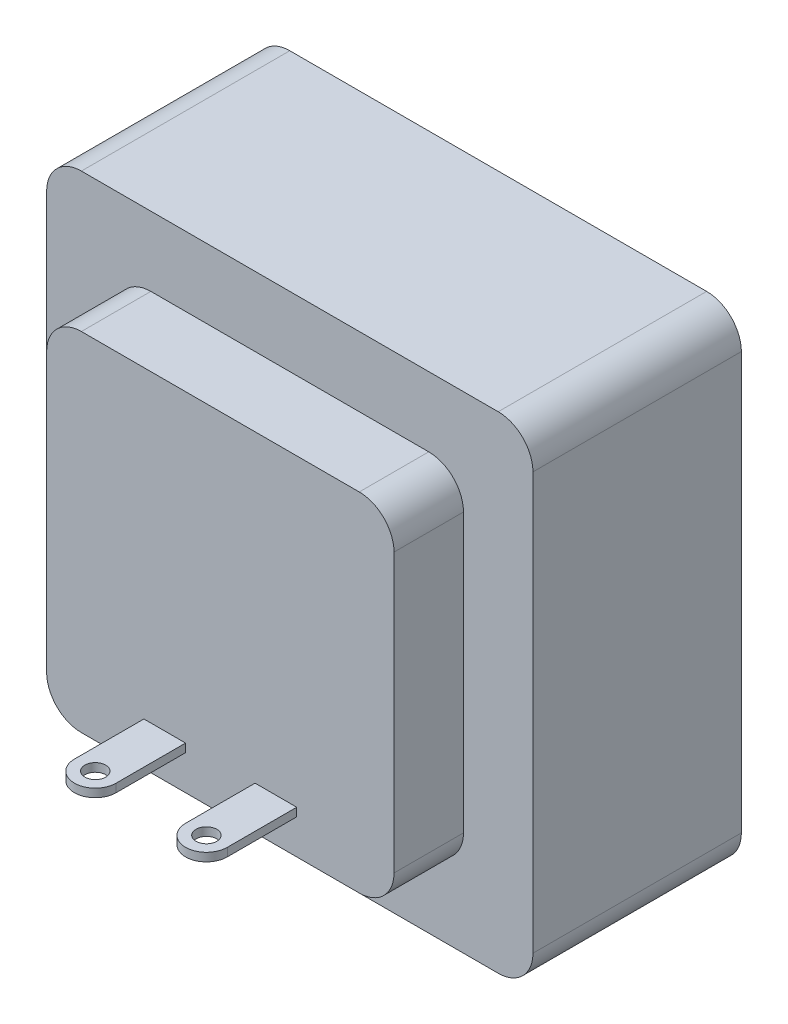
from build123d import *

# Parameters (mm, degrees)
SKETCH1_W           = 44.45
SKETCH1_H           = 44.45
BASE_EXTRUDE_DEPTH  = 9.525
BOSS_EXTRUDE1_START = -15.875
SKETCH2_W           = 31.75
SKETCH2_H           = 31.75
BOSS_EXTRUDE1_DEPTH = 31.75
FILLET1_R           = 3.175
SKETCH3_W           = 3.81
SKETCH3_H           = 0.762
BOSS_EXTRUDE2_DEPTH = 6.35
BOSS_EXTRUDE3_DEPTH = 0.762
SKETCH5_R           = 0.9525
CUT_EXTRUDE1_DEPTH  = 48.363679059


with BuildPart() as part:
    # Sketch1 → Base-Extrude (new, symmetric)
    with BuildSketch(Plane.XY):
        Rectangle(SKETCH1_W, SKETCH1_H)
    extrude(amount=BASE_EXTRUDE_DEPTH, both=True)

    # Sketch2 → Boss-Extrude1 (add)
    with BuildSketch(Plane(origin=(0, 0, 0), x_dir=(0, 0, -1), z_dir=(1, 0, 0)).offset(BOSS_EXTRUDE1_START)):
        Rectangle(SKETCH2_W, SKETCH2_H)
    extrude(amount=BOSS_EXTRUDE1_DEPTH)

    # Fillet1
    fillet1_edges = [part.edges().sort_by_distance(p)[0] for p in [
        (15.875, 15.875, -12.7),
        (15.875, -15.875, -12.7),
        (-15.875, -15.875, -12.7),
        (-15.875, 15.875, -12.7),
        (15.875, 15.875, 12.7),
        (15.875, -15.875, 12.7),
        (-15.875, -15.875, 12.7),
        (-15.875, 15.875, 12.7),
        (-22.225, 22.225, 0),
        (22.225, 22.225, 0),
        (22.225, -22.225, 0),
        (-22.225, -22.225, 0),
    ]]
    fillet(fillet1_edges, radius=FILLET1_R)

    # Sketch3 → Boss-Extrude2 (add)
    with BuildSketch(Plane.XY.offset(15.875)):
        with Locations((-5.08, -12.319)):
            Rectangle(SKETCH3_W, SKETCH3_H)
        with Locations((5.08, -12.319)):
            Rectangle(SKETCH3_W, SKETCH3_H)
    extrude(amount=BOSS_EXTRUDE2_DEPTH)

    # Sketch4 → Boss-Extrude3 (add)
    with BuildSketch(Plane(origin=(0, -11.938, 0), x_dir=(-1, 0, 0), z_dir=(0, 1, 0))):
        with BuildLine():
            Line((-6.985, 22.225), (-3.175, 22.225))
            ThreePointArc((-3.175, 22.225), (-5.08, 24.13), (-6.985, 22.225))
        make_face()
        with BuildLine():
            Line((3.175, 22.225), (6.985, 22.225))
            ThreePointArc((6.985, 22.225), (5.08, 24.13), (3.175, 22.225))
        make_face()
    extrude(amount=-BOSS_EXTRUDE3_DEPTH)

    # Sketch5 → Cut-Extrude1 (cut, through all)
    with BuildSketch(Plane(origin=(0, -11.938, 0), x_dir=(-1, 0, 0), z_dir=(0, 1, 0))):
        with Locations(Location((5.08, 22.225, 0), (0, 0, 90))):
            Circle(SKETCH5_R)
        with Locations(Location((-5.08, 22.225, 0), (0, 0, 90))):
            Circle(SKETCH5_R)
    extrude(amount=-CUT_EXTRUDE1_DEPTH, mode=Mode.SUBTRACT)


solid = part.part
